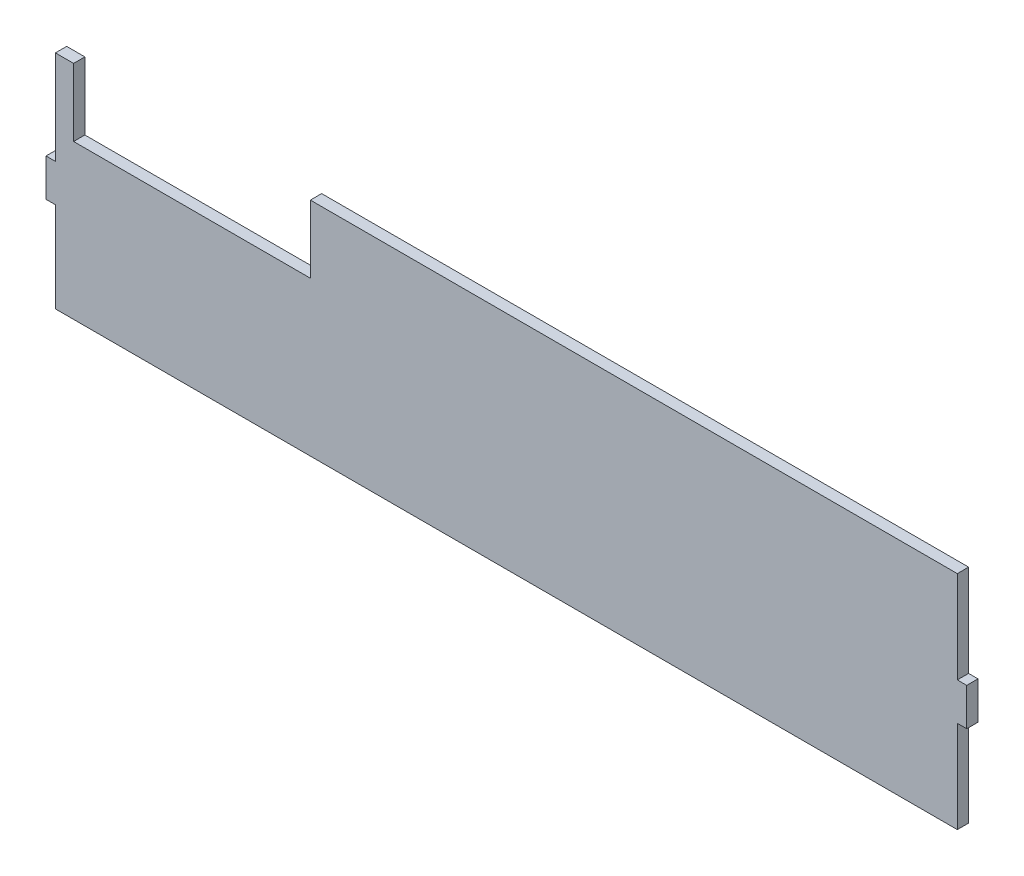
ISO-10303-21;
HEADER;
FILE_DESCRIPTION(('STEP AP214'),'2;1');
FILE_NAME('part.step','',(''),(''),'','','');
FILE_SCHEMA(('AUTOMOTIVE_DESIGN { 1 0 10303 214 1 1 1 1 }'));
ENDSEC;
DATA;
#1=APPLICATION_CONTEXT('core data for automotive mechanical design processes');
#2=APPLICATION_PROTOCOL_DEFINITION('international standard','automotive_design',2000,#1);
#3=PRODUCT_CONTEXT('',#1,'mechanical');
#4=PRODUCT('Part','Part','',(#3));
#5=PRODUCT_RELATED_PRODUCT_CATEGORY('part','',(#4));
#6=PRODUCT_DEFINITION_FORMATION('','',#4);
#7=PRODUCT_DEFINITION_CONTEXT('part definition',#1,'design');
#8=PRODUCT_DEFINITION('design','',#6,#7);
#9=PRODUCT_DEFINITION_SHAPE('','',#8);
#10=(LENGTH_UNIT() NAMED_UNIT(*) SI_UNIT(.MILLI.,.METRE.));
#11=(NAMED_UNIT(*) PLANE_ANGLE_UNIT() SI_UNIT($,.RADIAN.));
#12=(NAMED_UNIT(*) SI_UNIT($,.STERADIAN.) SOLID_ANGLE_UNIT());
#13=UNCERTAINTY_MEASURE_WITH_UNIT(LENGTH_MEASURE(1.E-05),#10,'distance_accuracy_value','');
#14=(GEOMETRIC_REPRESENTATION_CONTEXT(3) GLOBAL_UNCERTAINTY_ASSIGNED_CONTEXT((#13)) GLOBAL_UNIT_ASSIGNED_CONTEXT((#10,
#11,#12)) REPRESENTATION_CONTEXT('',''));
#15=CARTESIAN_POINT('',(0.,0.,0.));
#16=DIRECTION('',(0.,0.,1.));
#17=DIRECTION('',(1.,0.,0.));
#18=AXIS2_PLACEMENT_3D('',#15,#16,#17);
#19=CARTESIAN_POINT('',(-110.233637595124,44.45,3.81));
#20=DIRECTION('',(0.,-1.,0.));
#21=DIRECTION('',(0.,0.,-1.));
#22=AXIS2_PLACEMENT_3D('',#19,#20,#21);
#23=PLANE('',#22);
#24=DIRECTION('',(-1.,0.,0.));
#25=VECTOR('',#24,1.);
#26=CARTESIAN_POINT('',(-110.233637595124,44.45,3.81));
#27=LINE('',#26,#25);
#28=CARTESIAN_POINT('',(-104.07999396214,44.45,3.81));
#29=VERTEX_POINT('',#28);
#30=CARTESIAN_POINT('',(-110.233637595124,44.45,3.81));
#31=VERTEX_POINT('',#30);
#32=EDGE_CURVE('E204',#29,#31,#27,.T.);
#33=ORIENTED_EDGE('',*,*,#32,.F.);
#34=DIRECTION('',(0.,0.,1.));
#35=VECTOR('',#34,1.);
#36=CARTESIAN_POINT('',(-104.07999396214,44.45,0.));
#37=LINE('',#36,#35);
#38=CARTESIAN_POINT('',(-104.07999396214,44.45,0.));
#39=VERTEX_POINT('',#38);
#40=EDGE_CURVE('E161',#39,#29,#37,.T.);
#41=ORIENTED_EDGE('',*,*,#40,.F.);
#42=DIRECTION('',(-1.,0.,0.));
#43=VECTOR('',#42,1.);
#44=CARTESIAN_POINT('',(-110.233637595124,44.45,0.));
#45=LINE('',#44,#43);
#46=CARTESIAN_POINT('',(-110.233637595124,44.45,0.));
#47=VERTEX_POINT('',#46);
#48=EDGE_CURVE('E174',#39,#47,#45,.T.);
#49=ORIENTED_EDGE('',*,*,#48,.T.);
#50=DIRECTION('',(0.,0.,-1.));
#51=VECTOR('',#50,1.);
#52=CARTESIAN_POINT('',(-110.233637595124,44.45,3.81));
#53=LINE('',#52,#51);
#54=EDGE_CURVE('E11',#31,#47,#53,.T.);
#55=ORIENTED_EDGE('',*,*,#54,.F.);
#56=EDGE_LOOP('',(#33,#41,#49,#55));
#57=FACE_BOUND('',#56,.T.);
#58=ADVANCED_FACE('F31',(#57),#23,.F.);
#59=CARTESIAN_POINT('',(194.566362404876,44.45,0.));
#60=VERTEX_POINT('',#59);
#61=CARTESIAN_POINT('',(-24.0699939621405,44.45,0.));
#62=VERTEX_POINT('',#61);
#63=EDGE_CURVE('E179',#60,#62,#45,.T.);
#64=ORIENTED_EDGE('',*,*,#63,.T.);
#65=DIRECTION('',(0.,0.,1.));
#66=VECTOR('',#65,1.);
#67=CARTESIAN_POINT('',(-24.0699939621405,44.45,0.));
#68=LINE('',#67,#66);
#69=CARTESIAN_POINT('',(-24.0699939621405,44.45,3.81));
#70=VERTEX_POINT('',#69);
#71=EDGE_CURVE('E175',#62,#70,#68,.T.);
#72=ORIENTED_EDGE('',*,*,#71,.T.);
#73=CARTESIAN_POINT('',(194.566362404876,44.45,3.81));
#74=VERTEX_POINT('',#73);
#75=EDGE_CURVE('E205',#74,#70,#27,.T.);
#76=ORIENTED_EDGE('',*,*,#75,.F.);
#77=DIRECTION('',(0.,0.,-1.));
#78=VECTOR('',#77,1.);
#79=CARTESIAN_POINT('',(194.566362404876,44.45,3.81));
#80=LINE('',#79,#78);
#81=EDGE_CURVE('E228',#74,#60,#80,.T.);
#82=ORIENTED_EDGE('',*,*,#81,.T.);
#83=EDGE_LOOP('',(#64,#72,#76,#82));
#84=FACE_BOUND('',#83,.T.);
#85=ADVANCED_FACE('F33',(#84),#23,.F.);
#86=CARTESIAN_POINT('',(-110.233637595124,12.7,3.81));
#87=DIRECTION('',(1.,0.,0.));
#88=DIRECTION('',(0.,0.,-1.));
#89=AXIS2_PLACEMENT_3D('',#86,#87,#88);
#90=PLANE('',#89);
#91=DIRECTION('',(0.,-1.,0.));
#92=VECTOR('',#91,1.);
#93=CARTESIAN_POINT('',(-110.233637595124,12.7,0.));
#94=LINE('',#93,#92);
#95=CARTESIAN_POINT('',(-110.233637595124,12.7,0.));
#96=VERTEX_POINT('',#95);
#97=EDGE_CURVE('E182',#47,#96,#94,.T.);
#98=ORIENTED_EDGE('',*,*,#97,.T.);
#99=DIRECTION('',(0.,0.,-1.));
#100=VECTOR('',#99,1.);
#101=CARTESIAN_POINT('',(-110.233637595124,12.7,3.81));
#102=LINE('',#101,#100);
#103=CARTESIAN_POINT('',(-110.233637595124,12.7,3.81));
#104=VERTEX_POINT('',#103);
#105=EDGE_CURVE('E39',#104,#96,#102,.T.);
#106=ORIENTED_EDGE('',*,*,#105,.F.);
#107=DIRECTION('',(0.,-1.,0.));
#108=VECTOR('',#107,1.);
#109=CARTESIAN_POINT('',(-110.233637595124,12.7,3.81));
#110=LINE('',#109,#108);
#111=EDGE_CURVE('E207',#31,#104,#110,.T.);
#112=ORIENTED_EDGE('',*,*,#111,.F.);
#113=ORIENTED_EDGE('',*,*,#54,.T.);
#114=EDGE_LOOP('',(#98,#106,#112,#113));
#115=FACE_BOUND('',#114,.T.);
#116=ADVANCED_FACE('F284',(#115),#90,.F.);
#117=CARTESIAN_POINT('',(-113.408637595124,12.7,3.81));
#118=DIRECTION('',(0.,-1.,0.));
#119=DIRECTION('',(0.,0.,-1.));
#120=AXIS2_PLACEMENT_3D('',#117,#118,#119);
#121=PLANE('',#120);
#122=DIRECTION('',(-1.,0.,0.));
#123=VECTOR('',#122,1.);
#124=CARTESIAN_POINT('',(-113.408637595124,12.7,0.));
#125=LINE('',#124,#123);
#126=CARTESIAN_POINT('',(-113.408637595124,12.7,0.));
#127=VERTEX_POINT('',#126);
#128=EDGE_CURVE('E184',#96,#127,#125,.T.);
#129=ORIENTED_EDGE('',*,*,#128,.T.);
#130=DIRECTION('',(0.,0.,-1.));
#131=VECTOR('',#130,1.);
#132=CARTESIAN_POINT('',(-113.408637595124,12.7,3.81));
#133=LINE('',#132,#131);
#134=CARTESIAN_POINT('',(-113.408637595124,12.7,3.81));
#135=VERTEX_POINT('',#134);
#136=EDGE_CURVE('E255',#135,#127,#133,.T.);
#137=ORIENTED_EDGE('',*,*,#136,.F.);
#138=DIRECTION('',(-1.,0.,0.));
#139=VECTOR('',#138,1.);
#140=CARTESIAN_POINT('',(-113.408637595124,12.7,3.81));
#141=LINE('',#140,#139);
#142=EDGE_CURVE('E209',#104,#135,#141,.T.);
#143=ORIENTED_EDGE('',*,*,#142,.F.);
#144=ORIENTED_EDGE('',*,*,#105,.T.);
#145=EDGE_LOOP('',(#129,#137,#143,#144));
#146=FACE_BOUND('',#145,.T.);
#147=ADVANCED_FACE('F262',(#146),#121,.F.);
#148=CARTESIAN_POINT('',(-113.408637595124,12.7,3.81));
#149=DIRECTION('',(1.,0.,0.));
#150=DIRECTION('',(0.,0.,-1.));
#151=AXIS2_PLACEMENT_3D('',#148,#149,#150);
#152=PLANE('',#151);
#153=DIRECTION('',(0.,-1.,0.));
#154=VECTOR('',#153,1.);
#155=CARTESIAN_POINT('',(-113.408637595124,12.7,0.));
#156=LINE('',#155,#154);
#157=CARTESIAN_POINT('',(-113.408637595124,0.,0.));
#158=VERTEX_POINT('',#157);
#159=EDGE_CURVE('E186',#127,#158,#156,.T.);
#160=ORIENTED_EDGE('',*,*,#159,.T.);
#161=DIRECTION('',(0.,0.,-1.));
#162=VECTOR('',#161,1.);
#163=CARTESIAN_POINT('',(-113.408637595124,0.,3.81));
#164=LINE('',#163,#162);
#165=CARTESIAN_POINT('',(-113.408637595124,0.,3.81));
#166=VERTEX_POINT('',#165);
#167=EDGE_CURVE('E252',#166,#158,#164,.T.);
#168=ORIENTED_EDGE('',*,*,#167,.F.);
#169=DIRECTION('',(0.,-1.,0.));
#170=VECTOR('',#169,1.);
#171=CARTESIAN_POINT('',(-113.408637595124,12.7,3.81));
#172=LINE('',#171,#170);
#173=EDGE_CURVE('E211',#135,#166,#172,.T.);
#174=ORIENTED_EDGE('',*,*,#173,.F.);
#175=ORIENTED_EDGE('',*,*,#136,.T.);
#176=EDGE_LOOP('',(#160,#168,#174,#175));
#177=FACE_BOUND('',#176,.T.);
#178=ADVANCED_FACE('F275',(#177),#152,.F.);
#179=CARTESIAN_POINT('',(-113.408637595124,0.,3.81));
#180=DIRECTION('',(0.,1.,0.));
#181=DIRECTION('',(0.,0.,1.));
#182=AXIS2_PLACEMENT_3D('',#179,#180,#181);
#183=PLANE('',#182);
#184=DIRECTION('',(1.,0.,0.));
#185=VECTOR('',#184,1.);
#186=CARTESIAN_POINT('',(-113.408637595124,0.,0.));
#187=LINE('',#186,#185);
#188=CARTESIAN_POINT('',(-110.233637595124,0.,0.));
#189=VERTEX_POINT('',#188);
#190=EDGE_CURVE('E188',#158,#189,#187,.T.);
#191=ORIENTED_EDGE('',*,*,#190,.T.);
#192=DIRECTION('',(0.,0.,-1.));
#193=VECTOR('',#192,1.);
#194=CARTESIAN_POINT('',(-110.233637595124,0.,3.81));
#195=LINE('',#194,#193);
#196=CARTESIAN_POINT('',(-110.233637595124,0.,3.81));
#197=VERTEX_POINT('',#196);
#198=EDGE_CURVE('E249',#197,#189,#195,.T.);
#199=ORIENTED_EDGE('',*,*,#198,.F.);
#200=DIRECTION('',(1.,0.,0.));
#201=VECTOR('',#200,1.);
#202=CARTESIAN_POINT('',(-113.408637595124,0.,3.81));
#203=LINE('',#202,#201);
#204=EDGE_CURVE('E213',#166,#197,#203,.T.);
#205=ORIENTED_EDGE('',*,*,#204,.F.);
#206=ORIENTED_EDGE('',*,*,#167,.T.);
#207=EDGE_LOOP('',(#191,#199,#205,#206));
#208=FACE_BOUND('',#207,.T.);
#209=ADVANCED_FACE('F279',(#208),#183,.F.);
#210=CARTESIAN_POINT('',(-110.233637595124,0.,3.81));
#211=DIRECTION('',(1.,0.,0.));
#212=DIRECTION('',(0.,0.,-1.));
#213=AXIS2_PLACEMENT_3D('',#210,#211,#212);
#214=PLANE('',#213);
#215=DIRECTION('',(0.,-1.,0.));
#216=VECTOR('',#215,1.);
#217=CARTESIAN_POINT('',(-110.233637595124,0.,0.));
#218=LINE('',#217,#216);
#219=CARTESIAN_POINT('',(-110.233637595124,-30.48,0.));
#220=VERTEX_POINT('',#219);
#221=EDGE_CURVE('E190',#189,#220,#218,.T.);
#222=ORIENTED_EDGE('',*,*,#221,.T.);
#223=DIRECTION('',(0.,0.,-1.));
#224=VECTOR('',#223,1.);
#225=CARTESIAN_POINT('',(-110.233637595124,-30.48,3.81));
#226=LINE('',#225,#224);
#227=CARTESIAN_POINT('',(-110.233637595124,-30.48,3.81));
#228=VERTEX_POINT('',#227);
#229=EDGE_CURVE('E246',#228,#220,#226,.T.);
#230=ORIENTED_EDGE('',*,*,#229,.F.);
#231=DIRECTION('',(0.,-1.,0.));
#232=VECTOR('',#231,1.);
#233=CARTESIAN_POINT('',(-110.233637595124,0.,3.81));
#234=LINE('',#233,#232);
#235=EDGE_CURVE('E215',#197,#228,#234,.T.);
#236=ORIENTED_EDGE('',*,*,#235,.F.);
#237=ORIENTED_EDGE('',*,*,#198,.T.);
#238=EDGE_LOOP('',(#222,#230,#236,#237));
#239=FACE_BOUND('',#238,.T.);
#240=ADVANCED_FACE('F318',(#239),#214,.F.);
#241=CARTESIAN_POINT('',(-110.233637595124,-30.48,3.81));
#242=DIRECTION('',(0.,1.,0.));
#243=DIRECTION('',(0.,0.,1.));
#244=AXIS2_PLACEMENT_3D('',#241,#242,#243);
#245=PLANE('',#244);
#246=DIRECTION('',(1.,0.,0.));
#247=VECTOR('',#246,1.);
#248=CARTESIAN_POINT('',(-110.233637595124,-30.48,0.));
#249=LINE('',#248,#247);
#250=CARTESIAN_POINT('',(194.566362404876,-30.48,0.));
#251=VERTEX_POINT('',#250);
#252=EDGE_CURVE('E192',#220,#251,#249,.T.);
#253=ORIENTED_EDGE('',*,*,#252,.T.);
#254=DIRECTION('',(0.,0.,-1.));
#255=VECTOR('',#254,1.);
#256=CARTESIAN_POINT('',(194.566362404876,-30.48,3.81));
#257=LINE('',#256,#255);
#258=CARTESIAN_POINT('',(194.566362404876,-30.48,3.81));
#259=VERTEX_POINT('',#258);
#260=EDGE_CURVE('E243',#259,#251,#257,.T.);
#261=ORIENTED_EDGE('',*,*,#260,.F.);
#262=DIRECTION('',(1.,0.,0.));
#263=VECTOR('',#262,1.);
#264=CARTESIAN_POINT('',(-110.233637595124,-30.48,3.81));
#265=LINE('',#264,#263);
#266=EDGE_CURVE('E217',#228,#259,#265,.T.);
#267=ORIENTED_EDGE('',*,*,#266,.F.);
#268=ORIENTED_EDGE('',*,*,#229,.T.);
#269=EDGE_LOOP('',(#253,#261,#267,#268));
#270=FACE_BOUND('',#269,.T.);
#271=ADVANCED_FACE('F316',(#270),#245,.F.);
#272=CARTESIAN_POINT('',(194.566362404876,0.635000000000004,3.81));
#273=DIRECTION('',(-1.,0.,0.));
#274=DIRECTION('',(0.,0.,1.));
#275=AXIS2_PLACEMENT_3D('',#272,#273,#274);
#276=PLANE('',#275);
#277=DIRECTION('',(0.,1.,0.));
#278=VECTOR('',#277,1.);
#279=CARTESIAN_POINT('',(194.566362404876,0.635000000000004,0.));
#280=LINE('',#279,#278);
#281=CARTESIAN_POINT('',(194.566362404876,0.635000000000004,0.));
#282=VERTEX_POINT('',#281);
#283=EDGE_CURVE('E194',#251,#282,#280,.T.);
#284=ORIENTED_EDGE('',*,*,#283,.T.);
#285=DIRECTION('',(0.,0.,-1.));
#286=VECTOR('',#285,1.);
#287=CARTESIAN_POINT('',(194.566362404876,0.635000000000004,3.81));
#288=LINE('',#287,#286);
#289=CARTESIAN_POINT('',(194.566362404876,0.635000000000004,3.81));
#290=VERTEX_POINT('',#289);
#291=EDGE_CURVE('E240',#290,#282,#288,.T.);
#292=ORIENTED_EDGE('',*,*,#291,.F.);
#293=DIRECTION('',(0.,1.,0.));
#294=VECTOR('',#293,1.);
#295=CARTESIAN_POINT('',(194.566362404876,0.635000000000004,3.81));
#296=LINE('',#295,#294);
#297=EDGE_CURVE('E219',#259,#290,#296,.T.);
#298=ORIENTED_EDGE('',*,*,#297,.F.);
#299=ORIENTED_EDGE('',*,*,#260,.T.);
#300=EDGE_LOOP('',(#284,#292,#298,#299));
#301=FACE_BOUND('',#300,.T.);
#302=ADVANCED_FACE('F311',(#301),#276,.F.);
#303=CARTESIAN_POINT('',(194.566362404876,0.635000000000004,3.81));
#304=DIRECTION('',(0.,1.,0.));
#305=DIRECTION('',(0.,0.,1.));
#306=AXIS2_PLACEMENT_3D('',#303,#304,#305);
#307=PLANE('',#306);
#308=DIRECTION('',(1.,0.,0.));
#309=VECTOR('',#308,1.);
#310=CARTESIAN_POINT('',(194.566362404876,0.635000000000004,0.));
#311=LINE('',#310,#309);
#312=CARTESIAN_POINT('',(197.741362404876,0.635000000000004,0.));
#313=VERTEX_POINT('',#312);
#314=EDGE_CURVE('E196',#282,#313,#311,.T.);
#315=ORIENTED_EDGE('',*,*,#314,.T.);
#316=DIRECTION('',(0.,0.,-1.));
#317=VECTOR('',#316,1.);
#318=CARTESIAN_POINT('',(197.741362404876,0.635000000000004,3.81));
#319=LINE('',#318,#317);
#320=CARTESIAN_POINT('',(197.741362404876,0.635000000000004,3.81));
#321=VERTEX_POINT('',#320);
#322=EDGE_CURVE('E237',#321,#313,#319,.T.);
#323=ORIENTED_EDGE('',*,*,#322,.F.);
#324=DIRECTION('',(1.,0.,0.));
#325=VECTOR('',#324,1.);
#326=CARTESIAN_POINT('',(194.566362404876,0.635000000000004,3.81));
#327=LINE('',#326,#325);
#328=EDGE_CURVE('E221',#290,#321,#327,.T.);
#329=ORIENTED_EDGE('',*,*,#328,.F.);
#330=ORIENTED_EDGE('',*,*,#291,.T.);
#331=EDGE_LOOP('',(#315,#323,#329,#330));
#332=FACE_BOUND('',#331,.T.);
#333=ADVANCED_FACE('F306',(#332),#307,.F.);
#334=CARTESIAN_POINT('',(197.741362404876,13.335,3.81));
#335=DIRECTION('',(-1.,0.,0.));
#336=DIRECTION('',(0.,0.,1.));
#337=AXIS2_PLACEMENT_3D('',#334,#335,#336);
#338=PLANE('',#337);
#339=DIRECTION('',(0.,1.,0.));
#340=VECTOR('',#339,1.);
#341=CARTESIAN_POINT('',(197.741362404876,13.335,0.));
#342=LINE('',#341,#340);
#343=CARTESIAN_POINT('',(197.741362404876,13.335,0.));
#344=VERTEX_POINT('',#343);
#345=EDGE_CURVE('E198',#313,#344,#342,.T.);
#346=ORIENTED_EDGE('',*,*,#345,.T.);
#347=DIRECTION('',(0.,0.,-1.));
#348=VECTOR('',#347,1.);
#349=CARTESIAN_POINT('',(197.741362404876,13.335,3.81));
#350=LINE('',#349,#348);
#351=CARTESIAN_POINT('',(197.741362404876,13.335,3.81));
#352=VERTEX_POINT('',#351);
#353=EDGE_CURVE('E234',#352,#344,#350,.T.);
#354=ORIENTED_EDGE('',*,*,#353,.F.);
#355=DIRECTION('',(0.,1.,0.));
#356=VECTOR('',#355,1.);
#357=CARTESIAN_POINT('',(197.741362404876,13.335,3.81));
#358=LINE('',#357,#356);
#359=EDGE_CURVE('E223',#321,#352,#358,.T.);
#360=ORIENTED_EDGE('',*,*,#359,.F.);
#361=ORIENTED_EDGE('',*,*,#322,.T.);
#362=EDGE_LOOP('',(#346,#354,#360,#361));
#363=FACE_BOUND('',#362,.T.);
#364=ADVANCED_FACE('F302',(#363),#338,.F.);
#365=CARTESIAN_POINT('',(194.566362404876,13.335,3.81));
#366=DIRECTION('',(0.,-1.,0.));
#367=DIRECTION('',(0.,0.,-1.));
#368=AXIS2_PLACEMENT_3D('',#365,#366,#367);
#369=PLANE('',#368);
#370=DIRECTION('',(-1.,0.,0.));
#371=VECTOR('',#370,1.);
#372=CARTESIAN_POINT('',(194.566362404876,13.335,0.));
#373=LINE('',#372,#371);
#374=CARTESIAN_POINT('',(194.566362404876,13.335,0.));
#375=VERTEX_POINT('',#374);
#376=EDGE_CURVE('E200',#344,#375,#373,.T.);
#377=ORIENTED_EDGE('',*,*,#376,.T.);
#378=DIRECTION('',(0.,0.,-1.));
#379=VECTOR('',#378,1.);
#380=CARTESIAN_POINT('',(194.566362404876,13.335,3.81));
#381=LINE('',#380,#379);
#382=CARTESIAN_POINT('',(194.566362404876,13.335,3.81));
#383=VERTEX_POINT('',#382);
#384=EDGE_CURVE('E231',#383,#375,#381,.T.);
#385=ORIENTED_EDGE('',*,*,#384,.F.);
#386=DIRECTION('',(-1.,0.,0.));
#387=VECTOR('',#386,1.);
#388=CARTESIAN_POINT('',(194.566362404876,13.335,3.81));
#389=LINE('',#388,#387);
#390=EDGE_CURVE('E225',#352,#383,#389,.T.);
#391=ORIENTED_EDGE('',*,*,#390,.F.);
#392=ORIENTED_EDGE('',*,*,#353,.T.);
#393=EDGE_LOOP('',(#377,#385,#391,#392));
#394=FACE_BOUND('',#393,.T.);
#395=ADVANCED_FACE('F297',(#394),#369,.F.);
#396=CARTESIAN_POINT('',(194.566362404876,13.335,3.81));
#397=DIRECTION('',(-1.,0.,0.));
#398=DIRECTION('',(0.,0.,1.));
#399=AXIS2_PLACEMENT_3D('',#396,#397,#398);
#400=PLANE('',#399);
#401=DIRECTION('',(0.,1.,0.));
#402=VECTOR('',#401,1.);
#403=CARTESIAN_POINT('',(194.566362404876,13.335,0.));
#404=LINE('',#403,#402);
#405=EDGE_CURVE('E202',#375,#60,#404,.T.);
#406=ORIENTED_EDGE('',*,*,#405,.T.);
#407=ORIENTED_EDGE('',*,*,#81,.F.);
#408=DIRECTION('',(0.,1.,0.));
#409=VECTOR('',#408,1.);
#410=CARTESIAN_POINT('',(194.566362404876,13.335,3.81));
#411=LINE('',#410,#409);
#412=EDGE_CURVE('E54',#383,#74,#411,.T.);
#413=ORIENTED_EDGE('',*,*,#412,.F.);
#414=ORIENTED_EDGE('',*,*,#384,.T.);
#415=EDGE_LOOP('',(#406,#407,#413,#414));
#416=FACE_BOUND('',#415,.T.);
#417=ADVANCED_FACE('F291',(#416),#400,.F.);
#418=CARTESIAN_POINT('',(194.566362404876,44.45,3.81));
#419=DIRECTION('',(0.,0.,1.));
#420=DIRECTION('',(1.,0.,0.));
#421=AXIS2_PLACEMENT_3D('',#418,#419,#420);
#422=PLANE('',#421);
#423=DIRECTION('',(0.,-1.,0.));
#424=VECTOR('',#423,1.);
#425=CARTESIAN_POINT('',(-104.07999396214,44.45,3.81));
#426=LINE('',#425,#424);
#427=CARTESIAN_POINT('',(-104.07999396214,21.59,3.81));
#428=VERTEX_POINT('',#427);
#429=EDGE_CURVE('E158',#29,#428,#426,.T.);
#430=ORIENTED_EDGE('',*,*,#429,.F.);
#431=ORIENTED_EDGE('',*,*,#32,.T.);
#432=ORIENTED_EDGE('',*,*,#111,.T.);
#433=ORIENTED_EDGE('',*,*,#142,.T.);
#434=ORIENTED_EDGE('',*,*,#173,.T.);
#435=ORIENTED_EDGE('',*,*,#204,.T.);
#436=ORIENTED_EDGE('',*,*,#235,.T.);
#437=ORIENTED_EDGE('',*,*,#266,.T.);
#438=ORIENTED_EDGE('',*,*,#297,.T.);
#439=ORIENTED_EDGE('',*,*,#328,.T.);
#440=ORIENTED_EDGE('',*,*,#359,.T.);
#441=ORIENTED_EDGE('',*,*,#390,.T.);
#442=ORIENTED_EDGE('',*,*,#412,.T.);
#443=ORIENTED_EDGE('',*,*,#75,.T.);
#444=DIRECTION('',(0.,1.,0.));
#445=VECTOR('',#444,1.);
#446=CARTESIAN_POINT('',(-24.0699939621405,44.45,3.81));
#447=LINE('',#446,#445);
#448=CARTESIAN_POINT('',(-24.0699939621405,21.59,3.81));
#449=VERTEX_POINT('',#448);
#450=EDGE_CURVE('E165',#449,#70,#447,.T.);
#451=ORIENTED_EDGE('',*,*,#450,.F.);
#452=DIRECTION('',(1.,0.,0.));
#453=VECTOR('',#452,1.);
#454=CARTESIAN_POINT('',(-104.07999396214,21.59,3.81));
#455=LINE('',#454,#453);
#456=EDGE_CURVE('E149',#428,#449,#455,.T.);
#457=ORIENTED_EDGE('',*,*,#456,.F.);
#458=EDGE_LOOP('',(#430,#431,#432,#433,#434,#435,#436,#437,#438,#439,#440,#441,#442,#443,#451,#457));
#459=FACE_BOUND('',#458,.T.);
#460=ADVANCED_FACE('F164',(#459),#422,.T.);
#461=CARTESIAN_POINT('',(194.566362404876,44.45,0.));
#462=DIRECTION('',(0.,0.,1.));
#463=DIRECTION('',(1.,0.,0.));
#464=AXIS2_PLACEMENT_3D('',#461,#462,#463);
#465=PLANE('',#464);
#466=ORIENTED_EDGE('',*,*,#48,.F.);
#467=DIRECTION('',(0.,-1.,0.));
#468=VECTOR('',#467,1.);
#469=CARTESIAN_POINT('',(-104.07999396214,44.45,0.));
#470=LINE('',#469,#468);
#471=CARTESIAN_POINT('',(-104.07999396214,21.59,0.));
#472=VERTEX_POINT('',#471);
#473=EDGE_CURVE('E167',#39,#472,#470,.T.);
#474=ORIENTED_EDGE('',*,*,#473,.T.);
#475=DIRECTION('',(1.,0.,0.));
#476=VECTOR('',#475,1.);
#477=CARTESIAN_POINT('',(-104.07999396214,21.59,0.));
#478=LINE('',#477,#476);
#479=CARTESIAN_POINT('',(-24.0699939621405,21.59,0.));
#480=VERTEX_POINT('',#479);
#481=EDGE_CURVE('E152',#472,#480,#478,.T.);
#482=ORIENTED_EDGE('',*,*,#481,.T.);
#483=DIRECTION('',(0.,1.,0.));
#484=VECTOR('',#483,1.);
#485=CARTESIAN_POINT('',(-24.0699939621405,44.45,0.));
#486=LINE('',#485,#484);
#487=EDGE_CURVE('E46',#480,#62,#486,.T.);
#488=ORIENTED_EDGE('',*,*,#487,.T.);
#489=ORIENTED_EDGE('',*,*,#63,.F.);
#490=ORIENTED_EDGE('',*,*,#405,.F.);
#491=ORIENTED_EDGE('',*,*,#376,.F.);
#492=ORIENTED_EDGE('',*,*,#345,.F.);
#493=ORIENTED_EDGE('',*,*,#314,.F.);
#494=ORIENTED_EDGE('',*,*,#283,.F.);
#495=ORIENTED_EDGE('',*,*,#252,.F.);
#496=ORIENTED_EDGE('',*,*,#221,.F.);
#497=ORIENTED_EDGE('',*,*,#190,.F.);
#498=ORIENTED_EDGE('',*,*,#159,.F.);
#499=ORIENTED_EDGE('',*,*,#128,.F.);
#500=ORIENTED_EDGE('',*,*,#97,.F.);
#501=EDGE_LOOP('',(#466,#474,#482,#488,#489,#490,#491,#492,#493,#494,#495,#496,#497,#498,#499,#500));
#502=FACE_BOUND('',#501,.T.);
#503=ADVANCED_FACE('F270',(#502),#465,.F.);
#504=CARTESIAN_POINT('',(-104.07999396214,44.45,0.));
#505=DIRECTION('',(-1.,0.,0.));
#506=DIRECTION('',(0.,0.,1.));
#507=AXIS2_PLACEMENT_3D('',#504,#505,#506);
#508=PLANE('',#507);
#509=ORIENTED_EDGE('',*,*,#429,.T.);
#510=DIRECTION('',(0.,0.,1.));
#511=VECTOR('',#510,1.);
#512=CARTESIAN_POINT('',(-104.07999396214,21.59,0.));
#513=LINE('',#512,#511);
#514=EDGE_CURVE('E145',#472,#428,#513,.T.);
#515=ORIENTED_EDGE('',*,*,#514,.F.);
#516=ORIENTED_EDGE('',*,*,#473,.F.);
#517=ORIENTED_EDGE('',*,*,#40,.T.);
#518=EDGE_LOOP('',(#509,#515,#516,#517));
#519=FACE_BOUND('',#518,.T.);
#520=ADVANCED_FACE('F159',(#519),#508,.F.);
#521=CARTESIAN_POINT('',(-24.0699939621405,44.45,0.));
#522=DIRECTION('',(1.,0.,0.));
#523=DIRECTION('',(0.,1.,0.));
#524=AXIS2_PLACEMENT_3D('',#521,#522,#523);
#525=PLANE('',#524);
#526=ORIENTED_EDGE('',*,*,#450,.T.);
#527=ORIENTED_EDGE('',*,*,#71,.F.);
#528=ORIENTED_EDGE('',*,*,#487,.F.);
#529=DIRECTION('',(0.,0.,1.));
#530=VECTOR('',#529,1.);
#531=CARTESIAN_POINT('',(-24.0699939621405,21.59,0.));
#532=LINE('',#531,#530);
#533=EDGE_CURVE('E155',#480,#449,#532,.T.);
#534=ORIENTED_EDGE('',*,*,#533,.T.);
#535=EDGE_LOOP('',(#526,#527,#528,#534));
#536=FACE_BOUND('',#535,.T.);
#537=ADVANCED_FACE('F432',(#536),#525,.F.);
#538=CARTESIAN_POINT('',(-104.07999396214,21.59,0.));
#539=DIRECTION('',(0.,-1.,0.));
#540=DIRECTION('',(0.,0.,-1.));
#541=AXIS2_PLACEMENT_3D('',#538,#539,#540);
#542=PLANE('',#541);
#543=ORIENTED_EDGE('',*,*,#456,.T.);
#544=ORIENTED_EDGE('',*,*,#533,.F.);
#545=ORIENTED_EDGE('',*,*,#481,.F.);
#546=ORIENTED_EDGE('',*,*,#514,.T.);
#547=EDGE_LOOP('',(#543,#544,#545,#546));
#548=FACE_BOUND('',#547,.T.);
#549=ADVANCED_FACE('F147',(#548),#542,.F.);
#550=CLOSED_SHELL('',(#58,#85,#116,#147,#178,#209,#240,#271,#302,#333,#364,#395,#417,#460,#503,
#520,#537,#549));
#551=MANIFOLD_SOLID_BREP('B2',#550);
#552=ADVANCED_BREP_SHAPE_REPRESENTATION('',(#18,#551),#14);
#553=SHAPE_DEFINITION_REPRESENTATION(#9,#552);
ENDSEC;
END-ISO-10303-21;
